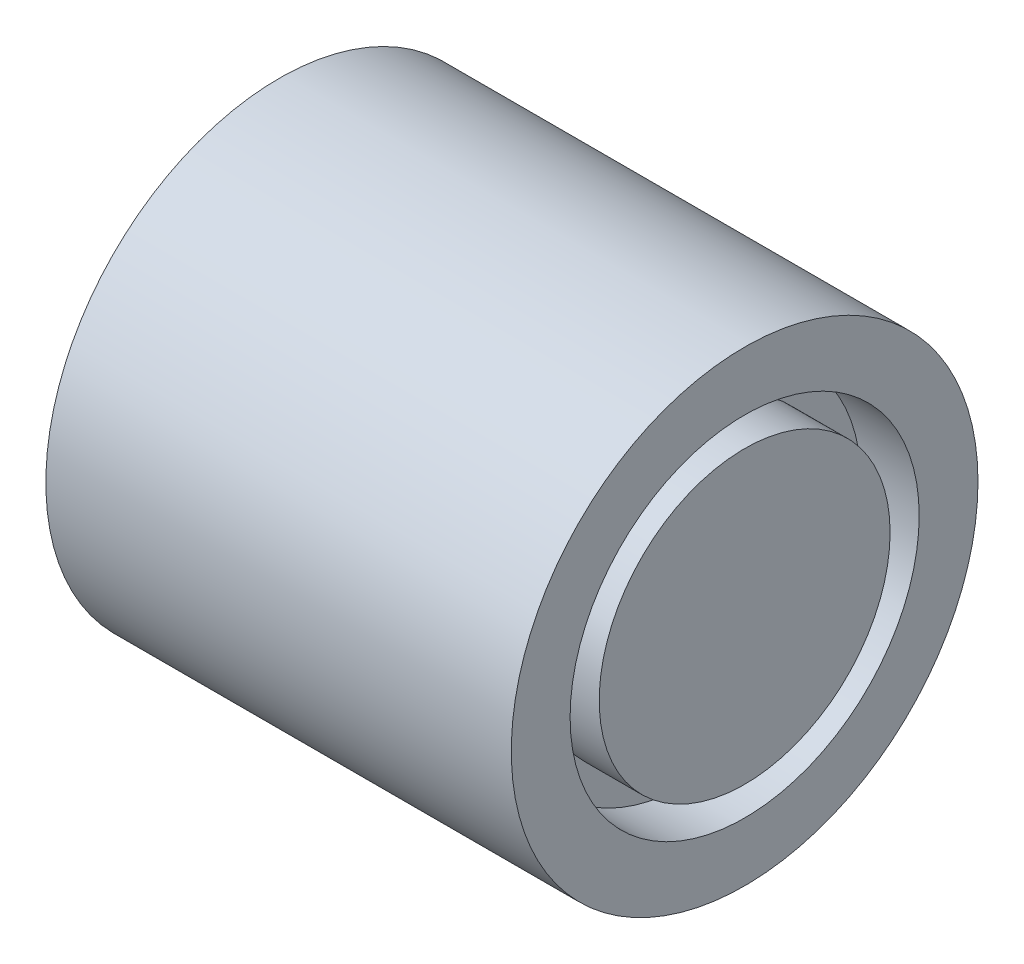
ISO-10303-21;
HEADER;
FILE_DESCRIPTION(('STEP AP214'),'2;1');
FILE_NAME('part.step','',(''),(''),'','','');
FILE_SCHEMA(('AUTOMOTIVE_DESIGN { 1 0 10303 214 1 1 1 1 }'));
ENDSEC;
DATA;
#1=APPLICATION_CONTEXT('core data for automotive mechanical design processes');
#2=APPLICATION_PROTOCOL_DEFINITION('international standard','automotive_design',2000,#1);
#3=PRODUCT_CONTEXT('',#1,'mechanical');
#4=PRODUCT('Part','Part','',(#3));
#5=PRODUCT_RELATED_PRODUCT_CATEGORY('part','',(#4));
#6=PRODUCT_DEFINITION_FORMATION('','',#4);
#7=PRODUCT_DEFINITION_CONTEXT('part definition',#1,'design');
#8=PRODUCT_DEFINITION('design','',#6,#7);
#9=PRODUCT_DEFINITION_SHAPE('','',#8);
#10=(LENGTH_UNIT() NAMED_UNIT(*) SI_UNIT(.MILLI.,.METRE.));
#11=(NAMED_UNIT(*) PLANE_ANGLE_UNIT() SI_UNIT($,.RADIAN.));
#12=(NAMED_UNIT(*) SI_UNIT($,.STERADIAN.) SOLID_ANGLE_UNIT());
#13=UNCERTAINTY_MEASURE_WITH_UNIT(LENGTH_MEASURE(1.E-05),#10,'distance_accuracy_value','');
#14=(GEOMETRIC_REPRESENTATION_CONTEXT(3) GLOBAL_UNCERTAINTY_ASSIGNED_CONTEXT((#13)) GLOBAL_UNIT_ASSIGNED_CONTEXT((#10,
#11,#12)) REPRESENTATION_CONTEXT('',''));
#15=CARTESIAN_POINT('',(0.,0.,0.));
#16=DIRECTION('',(0.,0.,1.));
#17=DIRECTION('',(1.,0.,0.));
#18=AXIS2_PLACEMENT_3D('',#15,#16,#17);
#19=CARTESIAN_POINT('',(0.,0.0685185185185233,0.));
#20=DIRECTION('',(1.,0.,0.));
#21=DIRECTION('',(0.,0.,-1.));
#22=AXIS2_PLACEMENT_3D('',#19,#20,#21);
#23=PLANE('',#22);
#24=CARTESIAN_POINT('',(0.,0.,0.));
#25=DIRECTION('',(1.,0.,0.));
#26=DIRECTION('',(0.,0.,-1.));
#27=AXIS2_PLACEMENT_3D('',#24,#25,#26);
#28=CIRCLE('',#27,19.05);
#29=CARTESIAN_POINT('',(0.,0.,-19.05));
#30=VERTEX_POINT('',#29);
#31=EDGE_CURVE('E47',#30,#30,#28,.T.);
#32=ORIENTED_EDGE('',*,*,#31,.F.);
#33=EDGE_LOOP('',(#32));
#34=FACE_BOUND('',#33,.T.);
#35=CARTESIAN_POINT('',(0.,0.,0.));
#36=DIRECTION('',(1.,0.,0.));
#37=DIRECTION('',(0.,0.,-1.));
#38=AXIS2_PLACEMENT_3D('',#35,#36,#37);
#39=CIRCLE('',#38,25.4685185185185);
#40=CARTESIAN_POINT('',(0.,0.,-25.4685185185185));
#41=VERTEX_POINT('',#40);
#42=EDGE_CURVE('E10',#41,#41,#39,.T.);
#43=ORIENTED_EDGE('',*,*,#42,.T.);
#44=EDGE_LOOP('',(#43));
#45=FACE_BOUND('',#44,.T.);
#46=ADVANCED_FACE('F33',(#34,#45),#23,.T.);
#47=CARTESIAN_POINT('',(11.589606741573,0.,0.));
#48=DIRECTION('',(1.,0.,0.));
#49=DIRECTION('',(0.,0.,-1.));
#50=AXIS2_PLACEMENT_3D('',#47,#48,#49);
#51=CYLINDRICAL_SURFACE('',#50,25.4685185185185);
#52=CARTESIAN_POINT('',(-50.8,0.,0.));
#53=DIRECTION('',(1.,0.,0.));
#54=DIRECTION('',(0.,0.,-1.));
#55=AXIS2_PLACEMENT_3D('',#52,#53,#54);
#56=CIRCLE('',#55,25.4685185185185);
#57=CARTESIAN_POINT('',(-50.8,0.,-25.4685185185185));
#58=VERTEX_POINT('',#57);
#59=EDGE_CURVE('E39',#58,#58,#56,.T.);
#60=ORIENTED_EDGE('',*,*,#59,.T.);
#61=EDGE_LOOP('',(#60));
#62=FACE_BOUND('',#61,.T.);
#63=ORIENTED_EDGE('',*,*,#42,.F.);
#64=EDGE_LOOP('',(#63));
#65=FACE_BOUND('',#64,.T.);
#66=ADVANCED_FACE('F88',(#62,#65),#51,.T.);
#67=CARTESIAN_POINT('',(-50.8,25.4685185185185,0.));
#68=DIRECTION('',(-1.,0.,0.));
#69=DIRECTION('',(0.,0.,1.));
#70=AXIS2_PLACEMENT_3D('',#67,#68,#69);
#71=PLANE('',#70);
#72=CARTESIAN_POINT('',(-50.8,0.,0.));
#73=DIRECTION('',(-1.,0.,0.));
#74=DIRECTION('',(0.,0.,1.));
#75=AXIS2_PLACEMENT_3D('',#72,#73,#74);
#76=CIRCLE('',#75,19.05);
#77=CARTESIAN_POINT('',(-50.8,0.,19.05));
#78=VERTEX_POINT('',#77);
#79=EDGE_CURVE('E61',#78,#78,#76,.T.);
#80=ORIENTED_EDGE('',*,*,#79,.F.);
#81=EDGE_LOOP('',(#80));
#82=FACE_BOUND('',#81,.T.);
#83=ORIENTED_EDGE('',*,*,#59,.F.);
#84=EDGE_LOOP('',(#83));
#85=FACE_BOUND('',#84,.T.);
#86=ADVANCED_FACE('F83',(#82,#85),#71,.T.);
#87=CARTESIAN_POINT('',(-6.35,0.,0.));
#88=DIRECTION('',(1.,0.,0.));
#89=DIRECTION('',(0.,0.,-1.));
#90=AXIS2_PLACEMENT_3D('',#87,#88,#89);
#91=CYLINDRICAL_SURFACE('',#90,19.05);
#92=CARTESIAN_POINT('',(-6.35,0.,0.));
#93=DIRECTION('',(1.,0.,0.));
#94=DIRECTION('',(0.,0.,-1.));
#95=AXIS2_PLACEMENT_3D('',#92,#93,#94);
#96=CIRCLE('',#95,19.05);
#97=CARTESIAN_POINT('',(-6.35,0.,-19.05));
#98=VERTEX_POINT('',#97);
#99=EDGE_CURVE('E43',#98,#98,#96,.T.);
#100=ORIENTED_EDGE('',*,*,#99,.F.);
#101=EDGE_LOOP('',(#100));
#102=FACE_BOUND('',#101,.T.);
#103=ORIENTED_EDGE('',*,*,#31,.T.);
#104=EDGE_LOOP('',(#103));
#105=FACE_BOUND('',#104,.T.);
#106=ADVANCED_FACE('F112',(#102,#105),#91,.F.);
#107=CARTESIAN_POINT('',(-6.35,0.,0.));
#108=DIRECTION('',(1.,0.,0.));
#109=DIRECTION('',(0.,0.,-1.));
#110=AXIS2_PLACEMENT_3D('',#107,#108,#109);
#111=PLANE('',#110);
#112=CARTESIAN_POINT('',(-6.35,0.,0.));
#113=DIRECTION('',(1.,0.,0.));
#114=DIRECTION('',(0.,0.,-1.));
#115=AXIS2_PLACEMENT_3D('',#112,#113,#114);
#116=CIRCLE('',#115,15.875);
#117=CARTESIAN_POINT('',(-6.35,0.,-15.875));
#118=VERTEX_POINT('',#117);
#119=EDGE_CURVE('E52',#118,#118,#116,.T.);
#120=ORIENTED_EDGE('',*,*,#119,.F.);
#121=EDGE_LOOP('',(#120));
#122=FACE_BOUND('',#121,.T.);
#123=ORIENTED_EDGE('',*,*,#99,.T.);
#124=EDGE_LOOP('',(#123));
#125=FACE_BOUND('',#124,.T.);
#126=ADVANCED_FACE('F104',(#122,#125),#111,.T.);
#127=CARTESIAN_POINT('',(-6.35,0.,0.));
#128=DIRECTION('',(1.,0.,0.));
#129=DIRECTION('',(0.,0.,-1.));
#130=AXIS2_PLACEMENT_3D('',#127,#128,#129);
#131=CYLINDRICAL_SURFACE('',#130,15.875);
#132=ORIENTED_EDGE('',*,*,#119,.T.);
#133=EDGE_LOOP('',(#132));
#134=FACE_BOUND('',#133,.T.);
#135=CARTESIAN_POINT('',(0.,0.,0.));
#136=DIRECTION('',(1.,0.,0.));
#137=DIRECTION('',(0.,0.,-1.));
#138=AXIS2_PLACEMENT_3D('',#135,#136,#137);
#139=CIRCLE('',#138,15.875);
#140=CARTESIAN_POINT('',(0.,0.,-15.875));
#141=VERTEX_POINT('',#140);
#142=EDGE_CURVE('E55',#141,#141,#139,.T.);
#143=ORIENTED_EDGE('',*,*,#142,.F.);
#144=EDGE_LOOP('',(#143));
#145=FACE_BOUND('',#144,.T.);
#146=ADVANCED_FACE('F96',(#134,#145),#131,.T.);
#147=ORIENTED_EDGE('',*,*,#142,.T.);
#148=EDGE_LOOP('',(#147));
#149=FACE_BOUND('',#148,.T.);
#150=ADVANCED_FACE('F90',(#149),#23,.T.);
#151=CARTESIAN_POINT('',(-44.45,0.,0.));
#152=DIRECTION('',(-1.,0.,0.));
#153=DIRECTION('',(0.,0.,1.));
#154=AXIS2_PLACEMENT_3D('',#151,#152,#153);
#155=CYLINDRICAL_SURFACE('',#154,19.05);
#156=CARTESIAN_POINT('',(-44.45,0.,0.));
#157=DIRECTION('',(-1.,0.,0.));
#158=DIRECTION('',(0.,0.,1.));
#159=AXIS2_PLACEMENT_3D('',#156,#157,#158);
#160=CIRCLE('',#159,19.05);
#161=CARTESIAN_POINT('',(-44.45,0.,19.05));
#162=VERTEX_POINT('',#161);
#163=EDGE_CURVE('E58',#162,#162,#160,.T.);
#164=ORIENTED_EDGE('',*,*,#163,.F.);
#165=EDGE_LOOP('',(#164));
#166=FACE_BOUND('',#165,.T.);
#167=ORIENTED_EDGE('',*,*,#79,.T.);
#168=EDGE_LOOP('',(#167));
#169=FACE_BOUND('',#168,.T.);
#170=ADVANCED_FACE('F84',(#166,#169),#155,.F.);
#171=CARTESIAN_POINT('',(-44.45,0.,0.));
#172=DIRECTION('',(-1.,0.,0.));
#173=DIRECTION('',(0.,0.,1.));
#174=AXIS2_PLACEMENT_3D('',#171,#172,#173);
#175=PLANE('',#174);
#176=CARTESIAN_POINT('',(-44.45,0.,0.));
#177=DIRECTION('',(-1.,0.,0.));
#178=DIRECTION('',(0.,0.,1.));
#179=AXIS2_PLACEMENT_3D('',#176,#177,#178);
#180=CIRCLE('',#179,15.875);
#181=CARTESIAN_POINT('',(-44.45,0.,15.875));
#182=VERTEX_POINT('',#181);
#183=EDGE_CURVE('E64',#182,#182,#180,.T.);
#184=ORIENTED_EDGE('',*,*,#183,.F.);
#185=EDGE_LOOP('',(#184));
#186=FACE_BOUND('',#185,.T.);
#187=ORIENTED_EDGE('',*,*,#163,.T.);
#188=EDGE_LOOP('',(#187));
#189=FACE_BOUND('',#188,.T.);
#190=ADVANCED_FACE('F75',(#186,#189),#175,.T.);
#191=CARTESIAN_POINT('',(-44.45,0.,0.));
#192=DIRECTION('',(-1.,0.,0.));
#193=DIRECTION('',(0.,0.,1.));
#194=AXIS2_PLACEMENT_3D('',#191,#192,#193);
#195=CYLINDRICAL_SURFACE('',#194,15.875);
#196=ORIENTED_EDGE('',*,*,#183,.T.);
#197=EDGE_LOOP('',(#196));
#198=FACE_BOUND('',#197,.T.);
#199=CARTESIAN_POINT('',(-50.8,0.,0.));
#200=DIRECTION('',(-1.,0.,0.));
#201=DIRECTION('',(0.,0.,1.));
#202=AXIS2_PLACEMENT_3D('',#199,#200,#201);
#203=CIRCLE('',#202,15.875);
#204=CARTESIAN_POINT('',(-50.8,0.,15.875));
#205=VERTEX_POINT('',#204);
#206=EDGE_CURVE('E67',#205,#205,#203,.T.);
#207=ORIENTED_EDGE('',*,*,#206,.F.);
#208=EDGE_LOOP('',(#207));
#209=FACE_BOUND('',#208,.T.);
#210=ADVANCED_FACE('F73',(#198,#209),#195,.T.);
#211=ORIENTED_EDGE('',*,*,#206,.T.);
#212=EDGE_LOOP('',(#211));
#213=FACE_BOUND('',#212,.T.);
#214=ADVANCED_FACE('F71',(#213),#71,.T.);
#215=CLOSED_SHELL('',(#46,#66,#86,#106,#126,#146,#150,#170,#190,#210,#214));
#216=MANIFOLD_SOLID_BREP('B2',#215);
#217=ADVANCED_BREP_SHAPE_REPRESENTATION('',(#18,#216),#14);
#218=SHAPE_DEFINITION_REPRESENTATION(#9,#217);
ENDSEC;
END-ISO-10303-21;
